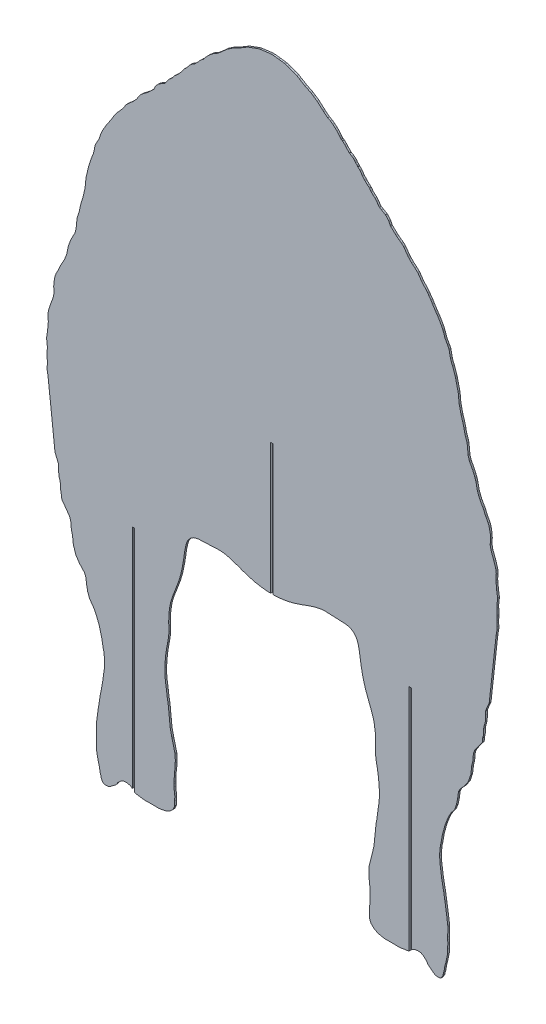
from build123d import *

# Parameters (mm, degrees)
EXTRUDE_1_DEPTH = 2


with BuildPart() as part:
    # Model → Extrude 1 (new body)
    with BuildSketch(Plane.XY):
        Polygon((-5496.2445, 189.9029), (-5495.9096, 189.4966), (-5494.3551, 186.1631), (-5493.4235, 179.621), (-5493.4364, 179.0282), (-5492.0028, 172.1316), (-5491.8416, 171.8408), (-5491.6804, 171.5499), (-5490.0743, 166.7919), (-5489.6801, 166.2414), (-5489.4588, 165.9892), (-5489.2374, 165.737), (-5486.8596, 162.5707), (-5486.5667, 162.237), (-5486.2738, 161.9033), (-5484.7952, 159.28), (-5483.6149, 157.1755), (-5481.8233, 152.959), (-5481.7658, 152.7644), (-5481.7082, 152.5696), (-5480.7843, 150.3208), (-5480.0863, 148.4638), (-5479.4524, 147.0466), (-5479.2418, 146.1877), (-5476.2774, 135.1042), (-5474.7989, 126.6455), (-5474.1593, 124.0295), (-5473.7948, 121.4179), (-5473.392, 116.9064), (-5473.1167, 113.4783), (-5473.4549, 109.7988), (-5473.5587, 106.9177), (-5474.4143, 100.9123), (-5475.4951, 92.9453), (-5476.1924, 89.4713), (-5477.0354, 84.4822), (-5477.8445, 80.8982), (-5479.0215, 73.1225), (-5479.2856, 71.7514), (-5480.7816, 62.0454), (-5482.3022, 50.7461), (-5482.335, 50.2573), (-5482.3678, 49.7685), (-5482.3807, 48.9289), (-5482.2994, 39.0254), (-5482.2846, 36.1582), (-5482.418, 32.8984), (-5482.1374, 27.2427), (-5482.1283, 22.9883), (-5480.2995, 14.143), (-5480.0821, 13.1252), (-5480.0126, 12.9504), (-5479.943, 12.7754), (-5479.8217, 12.2882), (-5479.7004, 11.801), (-5478.7688, 8.2534), (-5478.5633, 5.9324), (-5478.0259, 3.5652), (-5477.6842, 2.6575), (-5477.1875, 0.3865), (-5476.9723, -0.7583), (-5475.4734, -3.2901), (-5475.135, -4.0174), (-5474.6471, -4.3303), (-5472.6105, -5.0435), (-5470.0517, -4.833), (-5468.8631, -4.739), (-5467.9083, -4.3711), (-5464.1485, -1.6074), (-5460.7275, 1.0117), (-5460.0107, 1.8904), (-5458.4354, 4.2187), (-5458.1438, 4.6213), (-5454.8446, 7.6282), (-5453.4923, 8.2492), (-5452.1635, 8.935), (-5449.5111, 9.2304), (-5449.0866, 9.2051), (-5448.6621, 9.1794), (-5448.5307, 9.1855), (-5448.3992, 9.1916), (-5447.2, 8.9678), (-5445.5066, 8.6291), (-5444.0579, 8.3113), (-5442.2299, 6.7488), (-5442.2299, 260.5305), (-5441.9799, 260.5305), (-5439.9799, 260.5305), (-5439.7299, 260.5305), (-5439.7299, 4.612), (-5438.7787, 3.7991), (-5434.6053, 3.1968), (-5430.5375, 2.5481), (-5427.125, 2.2878), (-5418.6017, 2.4498), (-5418.4295, 2.4263), (-5418.2572, 2.4028), (-5418.0674, 2.3752), (-5417.8775, 2.3476), (-5414.0434, 2.4126), (-5413.2241, 2.2605), (-5409.9278, 2.5803), (-5404.4787, 3.842), (-5404.2971, 3.862), (-5404.1256, 3.9563), (-5403.9541, 4.0503), (-5400.4633, 5.7129), (-5399.5392, 6.4496), (-5396.795, 9.0265), (-5396.635, 9.2409), (-5396.475, 9.4553), (-5395.3647, 11.9946), (-5394.8888, 13.2324), (-5394.7879, 18.3425), (-5394.5776, 22.6931), (-5394.7191, 24.8401), (-5395.2345, 28.1706), (-5395.3371, 31.6555), (-5395.4515, 34.6379), (-5395.3511, 36.647), (-5395.2123, 40.7546), (-5395.0561, 42.5802), (-5395.03, 45.147), (-5394.4729, 49.5852), (-5394.1224, 55.52), (-5394.0329, 58.1006), (-5394.3614, 63.8605), (-5394.4182, 64.4795), (-5394.5711, 65.0762), (-5397.6181, 77.3454), (-5397.8001, 77.905), (-5398.0493, 79.0061), (-5399.6808, 86.3602), (-5400.5667, 94.6023), (-5401.1657, 100.3725), (-5401.7546, 106.4187), (-5402.2491, 110.143), (-5403.0003, 114.0029), (-5403.9308, 121.3982), (-5405.2401, 130.3126), (-5405.2654, 130.8271), (-5405.7104, 135.5456), (-5405.7179, 141.811), (-5405.6925, 143.3755), (-5405.4861, 147.0115), (-5404.7015, 155.7778), (-5404.2753, 158.4779), (-5403.5142, 163.4328), (-5403.4329, 163.742), (-5402.5777, 168.0011), (-5402.4852, 168.4367), (-5401.8722, 172.4641), (-5401.2971, 177.0744), (-5401.243, 179.0469), (-5401.3137, 184.6592), (-5401.4301, 188.1054), (-5401.225, 196.1673), (-5401.1626, 197.2118), (-5400.453, 202.1882), (-5400.1592, 204.4477), (-5400.0922, 204.7002), (-5399.1198, 209.3453), (-5396.9029, 216.0772), (-5396.5681, 217.073), (-5395.5662, 219.4718), (-5393.1942, 225.6994), (-5390.6319, 232.5133), (-5389.0655, 237.5125), (-5387.8519, 241.9003), (-5386.7918, 246.574), (-5385.8331, 251.2091), (-5385.298, 254.2684), (-5384.5135, 259.1114), (-5383.836, 263.798), (-5383.3877, 266.9922), (-5382.6923, 270.2218), (-5382.0459, 273.2052), (-5381.0132, 276.1477), (-5380.199, 277.9815), (-5379.4204, 279.1903), (-5378.6526, 280.029), (-5377.137, 282.0069), (-5375.0265, 283.3319), (-5374.0647, 283.9898), (-5372.4247, 284.6144), (-5369.9607, 285.2689), (-5368.4474, 285.6445), (-5344.728, 286.6764), (-5340.5729, 286.369), (-5340.4043, 286.373), (-5340.0835, 286.36), (-5339.2209, 286.1743), (-5333.6626, 285.0128), (-5329.7618, 283.6271), (-5327.3638, 282.9614), (-5323.4804, 281.5655), (-5320.6819, 280.5334), (-5318.4154, 279.6736), (-5312.1751, 277.628), (-5306.9514, 276.1664), (-5304.8312, 275.614), (-5303.2028, 275.3152), (-5298.5116, 274.4743), (-5296.5531, 274.2131), (-5291.688, 273.7102), (-5289.2627, 273.5881), (-5287.2298, 273.546), (-5287.2298, 419.877), (-5286.9799, 419.877), (-5284.9799, 419.877), (-5284.7298, 419.877), (-5284.7298, 273.5372), (-5282.8709, 273.5877), (-5281.9771, 273.6062), (-5279.5518, 273.7285), (-5274.6867, 274.2312), (-5272.7281, 274.4925), (-5268.0369, 275.3334), (-5266.4085, 275.6322), (-5264.2884, 276.1846), (-5259.0647, 277.6462), (-5252.8244, 279.6919), (-5250.5579, 280.5516), (-5247.7593, 281.5837), (-5243.876, 282.9797), (-5241.4779, 283.6453), (-5237.5772, 285.0309), (-5232.0188, 286.1925), (-5231.1563, 286.3782), (-5230.8354, 286.3912), (-5230.6669, 286.3872), (-5226.5118, 286.6946), (-5202.7923, 285.6626), (-5201.2791, 285.2871), (-5198.8151, 284.6326), (-5197.175, 284.0081), (-5196.2132, 283.3501), (-5194.1028, 282.0251), (-5192.5872, 280.0472), (-5191.8194, 279.2085), (-5191.0408, 277.9997), (-5190.2266, 276.1659), (-5189.1939, 273.2234), (-5188.5475, 270.24), (-5187.8521, 267.0104), (-5187.4037, 263.8162), (-5186.7264, 259.1296), (-5185.9418, 254.2866), (-5185.4066, 251.2273), (-5184.4479, 246.5922), (-5183.3879, 241.9185), (-5182.1742, 237.5307), (-5180.6079, 232.5315), (-5178.0456, 225.7177), (-5175.6736, 219.4901), (-5174.6717, 217.0913), (-5174.3368, 216.0954), (-5172.1199, 209.3635), (-5171.1476, 204.7184), (-5171.0806, 204.4659), (-5170.7867, 202.2064), (-5170.0772, 197.23), (-5170.0147, 196.1855), (-5169.8097, 188.1236), (-5169.9261, 184.6773), (-5169.9967, 179.0652), (-5169.9427, 177.0925), (-5169.3676, 172.4823), (-5168.7545, 168.4551), (-5168.662, 168.0193), (-5167.8069, 163.7602), (-5167.7256, 163.4512), (-5166.9645, 158.4961), (-5166.5382, 155.7961), (-5165.7537, 147.0295), (-5165.5473, 143.3938), (-5165.5218, 141.8293), (-5165.5295, 135.5639), (-5165.9743, 130.8452), (-5165.9997, 130.3308), (-5167.309, 121.4165), (-5168.2394, 114.021), (-5168.9906, 110.1614), (-5169.4851, 106.437), (-5170.074, 100.3909), (-5170.673, 94.6205), (-5171.5589, 86.3784), (-5173.1905, 79.0244), (-5173.4397, 77.9232), (-5173.6216, 77.3635), (-5176.6686, 65.0942), (-5176.8216, 64.4978), (-5176.8785, 63.8786), (-5177.2069, 58.1186), (-5177.1173, 55.5381), (-5176.7669, 49.6035), (-5176.2097, 45.1653), (-5176.1837, 42.5984), (-5176.0275, 40.7729), (-5175.8887, 36.6653), (-5175.7882, 34.6562), (-5175.9026, 31.6738), (-5176.0053, 28.1887), (-5176.5207, 24.8584), (-5176.6621, 22.7112), (-5176.4518, 18.3606), (-5176.351, 13.2507), (-5175.8752, 12.0129), (-5174.7648, 9.4736), (-5174.6048, 9.259), (-5174.4447, 9.0447), (-5171.7006, 6.4678), (-5170.7764, 5.7309), (-5167.2857, 4.0686), (-5166.9427, 3.8804), (-5166.761, 3.8603), (-5161.3119, 2.5984), (-5158.0157, 2.2788), (-5157.1963, 2.4309), (-5153.3622, 2.3658), (-5153.1724, 2.3935), (-5152.9826, 2.4211), (-5152.638, 2.468), (-5144.1148, 2.3059), (-5140.7022, 2.5663), (-5136.6344, 3.2151), (-5132.4611, 3.8174), (-5132.2299, 4.0149), (-5132.2299, 260.5305), (-5131.9799, 260.5305), (-5129.9799, 260.5305), (-5129.7299, 260.5305), (-5129.7299, 6.1517), (-5127.1819, 8.3293), (-5125.7344, 8.6472), (-5124.0347, 8.9868), (-5122.8405, 9.2099), (-5122.5777, 9.1977), (-5121.7287, 9.2488), (-5119.0762, 8.9534), (-5117.7473, 8.2676), (-5116.3952, 7.6462), (-5113.096, 4.6394), (-5112.8044, 4.237), (-5111.229, 1.9087), (-5110.5122, 1.0298), (-5107.0912, -1.5894), (-5103.3315, -4.3528), (-5102.3766, -4.721), (-5101.188, -4.8147), (-5098.6293, -5.0254), (-5096.5927, -4.312), (-5096.1046, -3.9993), (-5095.7663, -3.2717), (-5094.2674, -0.7403), (-5094.0522, 0.4048), (-5093.5555, 2.6755), (-5093.2138, 3.5832), (-5092.6764, 5.9504), (-5092.471, 8.2715), (-5091.5393, 11.8191), (-5091.2967, 12.7937), (-5091.1576, 13.1435), (-5090.9402, 14.1611), (-5089.1114, 23.0066), (-5089.1023, 27.2607), (-5088.8218, 32.9165), (-5088.9552, 36.1765), (-5088.9403, 39.0437), (-5088.859, 48.947), (-5088.8721, 49.7868), (-5088.9377, 50.7641), (-5090.458, 62.0635), (-5091.9541, 71.7698), (-5092.2182, 73.1406), (-5093.3952, 80.9165), (-5094.2044, 84.5005), (-5095.0473, 89.4895), (-5095.7445, 92.9636), (-5096.8254, 100.9306), (-5097.6811, 106.9358), (-5097.7848, 109.8169), (-5098.1231, 113.4963), (-5097.8477, 116.9245), (-5097.445, 121.4363), (-5097.0805, 124.0478), (-5096.4408, 126.6636), (-5094.9624, 135.1223), (-5091.998, 146.206), (-5091.7874, 147.0647), (-5091.1535, 148.4822), (-5090.4555, 150.3388), (-5089.5315, 152.5879), (-5089.4164, 152.9773), (-5087.6248, 157.1936), (-5086.4446, 159.2981), (-5084.966, 161.9214), (-5084.3802, 162.5888), (-5082.0024, 165.7552), (-5081.5597, 166.2596), (-5081.1654, 166.81), (-5079.5594, 171.5681), (-5079.2368, 172.1498), (-5077.8033, 179.0464), (-5077.8162, 179.6391), (-5076.8756, 186.2084), (-5075.3302, 189.5149), (-5074.9953, 189.9211), (-5070.2549, 195.0317), (-5067.4744, 199.1148), (-5066.7221, 200.2868), (-5066.3842, 200.7108), (-5065.743, 201.8237), (-5064.6653, 205.0553), (-5063.9584, 207.6759), (-5063.1443, 209.5178), (-5062.1922, 217.4028), (-5062.0937, 218.5948), (-5060.8835, 223.4414), (-5060.4403, 227.1481), (-5060.3356, 229.7598), (-5059.9777, 231.8676), (-5059.8001, 232.7123), (-5058.6982, 235.6195), (-5057.3608, 237.4139), (-5055.286, 240.6368), (-5051.8067, 245.2318), (-5050.4565, 246.9567), (-5050.1734, 247.4129), (-5049.8714, 249.5642), (-5050.0432, 251.3419), (-5049.3152, 253.1749), (-5048.9193, 255.3772), (-5048.638, 261.0132), (-5048.6415, 261.8511), (-5048.1311, 264.2715), (-5046.8805, 268.9176), (-5046.7858, 269.6905), (-5046.7941, 270.0367), (-5046.3373, 276.3331), (-5046.6477, 279.1266), (-5046.5723, 279.8292), (-5043.2648, 287.8219), (-5042.8571, 288.6746), (-5042.523, 289.2183), (-5034.7941, 358.4404), (-5033.9411, 363.7396), (-5033.7005, 364.9829), (-5033.6393, 367.796), (-5034.0251, 371.3267), (-5034.0122, 373.0443), (-5033.5434, 377.2124), (-5033.4755, 378.4899), (-5033.543, 378.9758), (-5033.7709, 384.7782), (-5033.8905, 385.6756), (-5033.835, 388.5327), (-5033.0426, 395.6138), (-5033.0308, 395.8), (-5033.0113, 395.9221), (-5034.0009, 402.2862), (-5034.1834, 403.6155), (-5034.7428, 409.8151), (-5034.9175, 411.6043), (-5035.0041, 412.3087), (-5034.69, 417.1799), (-5034.5666, 418.7158), (-5034.8029, 421.4727), (-5035.1881, 423.4365), (-5037.1684, 429.8677), (-5040.4348, 438.5483), (-5041.3296, 443.1146), (-5041.3691, 443.3788), (-5041.3267, 444.4403), (-5041.2123, 445.7647), (-5041.05, 449.1643), (-5041.0439, 449.8028), (-5041.2307, 453.8414), (-5042.2644, 459.2745), (-5042.581, 460.5488), (-5043.7065, 463.6885), (-5045.5797, 467.0448), (-5046.3013, 468.5767), (-5046.8667, 469.5445), (-5048.4388, 473.2829), (-5049.5841, 475.5612), (-5052.7362, 481.0906), (-5054.006, 484.0773), (-5054.4533, 485.3843), (-5055.4709, 487.8962), (-5055.7193, 488.7455), (-5057.2304, 496.1335), (-5057.4883, 497.1829), (-5058.148, 499.1667), (-5058.4252, 500.0277), (-5058.4688, 500.1317), (-5058.5653, 500.4221), (-5059.5772, 502.834), (-5060.9157, 506.0546), (-5064.0276, 511.9442), (-5064.5601, 512.9406), (-5064.8484, 513.6022), (-5065.2777, 515.0453), (-5066.0171, 517.7166), (-5066.0555, 517.9199), (-5066.1033, 518.3999), (-5067.2262, 529.1884), (-5067.9337, 531.5906), (-5068.857, 534.2577), (-5069.5998, 536.4085), (-5070.4163, 540.1633), (-5070.6985, 541.5399), (-5070.7475, 541.9412), (-5072.1618, 547.3559), (-5073.7014, 552.4192), (-5073.897, 553.0191), (-5074.1014, 553.6592), (-5075.2986, 559.0795), (-5075.61, 560.6137), (-5076.1664, 562.4688), (-5076.7587, 568.8933), (-5077.0398, 572.0284), (-5077.3553, 573.8033), (-5079.0506, 581.0061), (-5080.0185, 585.034), (-5080.0987, 585.2922), (-5080.3587, 586.4795), (-5080.7127, 587.6883), (-5083.3742, 595.59), (-5083.5474, 595.9801), (-5083.6137, 596.1753), (-5084.9306, 599.1236), (-5085.699, 601.4732), (-5085.8715, 602.2506), (-5086.5213, 605.3258), (-5087.335, 609.4992), (-5087.3872, 609.7352), (-5087.6238, 610.4343), (-5088.5968, 612.3618), (-5089.0039, 613.0687), (-5089.5419, 614.1323), (-5090.6342, 616.0877), (-5091.3391, 617.3135), (-5091.8114, 618.2608), (-5092.3152, 619.4171), (-5092.7061, 620.5995), (-5092.9919, 621.5558), (-5093.3745, 622.6217), (-5093.751, 623.7605), (-5093.9125, 624.1204), (-5094.1559, 624.7987), (-5094.5435, 625.6594), (-5095.9634, 628.8488), (-5099.9745, 635.5974), (-5100.6933, 636.7075), (-5100.8407, 636.9388), (-5101.3076, 637.5334), (-5102.372, 639.1269), (-5103.0606, 640.1999), (-5105.9508, 644.5805), (-5107.8858, 647.8319), (-5109.8957, 650.6239), (-5110.5078, 651.4879), (-5111.3583, 652.7647), (-5112.0617, 653.7685), (-5113.1313, 654.8969), (-5118.2248, 660.6872), (-5120.7997, 664.425), (-5122.022, 666.2785), (-5122.8727, 667.2396), (-5125.8738, 669.9841), (-5128.0208, 671.8438), (-5129.314, 672.8506), (-5131.991, 675.6975), (-5132.193, 675.8821), (-5133.0651, 676.8199), (-5133.34, 677.1419), (-5133.4427, 677.2956), (-5134.3203, 678.5334), (-5137.7677, 683.4863), (-5137.9169, 683.7065), (-5138.3656, 684.1877), (-5140.1219, 685.9353), (-5140.9584, 686.5306), (-5141.0432, 686.6111), (-5143.4403, 688.3244), (-5145.8907, 690.1017), (-5146.93, 691.0391), (-5148.0558, 692.0564), (-5152.7876, 696.5155), (-5152.9189, 696.6485), (-5153.1773, 697.0911), (-5153.4561, 697.6513), (-5154.7262, 700.3167), (-5155.1989, 701.115), (-5157.6982, 703.8479), (-5158.6642, 704.8894), (-5158.954, 705.0564), (-5159.0568, 705.1352), (-5162.8114, 707.2138), (-5163.4601, 707.5739), (-5165.3329, 708.6862), (-5165.9826, 709.4375), (-5166.9042, 710.5417), (-5168.5414, 713.0396), (-5170.2736, 715.2407), (-5170.4103, 715.3523), (-5172.3112, 716.8386), (-5174.412, 718.8698), (-5175.2454, 720.02), (-5176.6067, 721.9037), (-5177.3058, 722.3524), (-5178.8534, 723.7779), (-5181.3047, 726.1082), (-5182.1029, 727.0691), (-5184.3199, 729.5573), (-5184.6825, 730.0232), (-5186.9003, 733.3016), (-5187.4988, 733.913), (-5189.6221, 735.8335), (-5190.1441, 736.6428), (-5190.3085, 736.812), (-5190.5365, 737.1518), (-5191.8145, 738.4364), (-5192.2515, 738.9975), (-5193.0279, 740.0662), (-5193.653, 740.7514), (-5193.7842, 740.8616), (-5194.0879, 741.1934), (-5195.1302, 742.0375), (-5196.0185, 742.6542), (-5196.1302, 742.7412), (-5196.2445, 742.8111), (-5196.3466, 742.8817), (-5198.8557, 744.4318), (-5199.064, 744.5517), (-5199.3466, 744.8617), (-5202.7245, 748.2428), (-5204.378, 750.1881), (-5206.8123, 752.5511), (-5207.44, 752.8542), (-5207.9518, 753.0932), (-5208.3108, 753.2658), (-5208.9171, 753.9361), (-5209.48, 754.7445), (-5210.0413, 755.5661), (-5210.1126, 755.6533), (-5210.2045, 755.7853), (-5211.392, 757.2257), (-5213.174, 759.1156), (-5214.8889, 760.8438), (-5217.6465, 763.1935), (-5220.1735, 765.1009), (-5223.1254, 766.4351), (-5223.3573, 766.55), (-5227.6885, 770.1647), (-5228.7314, 771.0216), (-5228.9402, 771.2144), (-5235.2218, 776.8455), (-5239.1795, 779.5213), (-5241.815, 781.2598), (-5243.1548, 782.0095), (-5246.3211, 783.5489), (-5248.492, 784.6127), (-5254.5843, 788.1919), (-5257.9969, 790.315), (-5261.5255, 791.6499), (-5266.364, 793.3762), (-5267.9052, 794.0177), (-5268.3997, 794.1441), (-5270.7198, 794.9286), (-5271.8709, 795.1604), (-5272.1304, 795.2611), (-5277.9157, 796.0246), (-5278.1049, 796.0474), (-5278.4278, 796.0851), (-5284.3705, 796.7863), (-5286.8345, 796.791), (-5293.1042, 796.0696), (-5298.443, 795.3651), (-5298.9361, 795.2658), (-5299.1416, 795.2305), (-5300.5199, 794.9467), (-5303.1974, 794.0392), (-5303.3345, 793.9995), (-5304.8756, 793.3581), (-5308.3654, 792.1129), (-5309.9397, 791.5731), (-5313.2202, 790.3253), (-5316.7648, 788.1228), (-5322.7409, 784.6029), (-5324.8895, 783.5469), (-5327.9536, 782.0819), (-5329.3591, 781.2938), (-5331.872, 779.6397), (-5335.9052, 776.9075), (-5336.0179, 776.8273), (-5341.8514, 771.598), (-5342.2452, 771.2771), (-5342.4384, 771.0908), (-5342.554, 770.9658), (-5343.5512, 770.1465), (-5346.6599, 767.552), (-5347.9014, 766.5387), (-5348.2637, 766.3494), (-5351.0662, 765.0827), (-5351.7631, 764.5567), (-5353.2077, 763.4875), (-5353.4525, 763.2815), (-5353.5933, 763.1753), (-5354.6938, 762.2376), (-5356.3003, 760.8864), (-5358.1009, 759.0849), (-5359.8025, 757.2915), (-5361.1984, 755.5841), (-5362.3074, 753.9611), (-5362.9051, 753.2956), (-5364.3875, 752.5822), (-5366.8543, 750.1806), (-5366.9837, 750.0265), (-5368.5152, 748.2246), (-5371.8932, 744.8435), (-5372.166, 744.5462), (-5372.2973, 744.4761), (-5375.1095, 742.7594), (-5375.6456, 742.3413), (-5376.1096, 742.0193), (-5377.1518, 741.1752), (-5377.3115, 741.0008), (-5377.5868, 740.7696), (-5378.2119, 740.0844), (-5379.4022, 738.448), (-5380.7032, 737.1337), (-5380.8523, 736.9114), (-5381.0957, 736.661), (-5381.6739, 735.7644), (-5383.7409, 733.8948), (-5383.8813, 733.7523), (-5384.0977, 733.5303), (-5384.3576, 733.2631), (-5384.6067, 732.8885), (-5386.5572, 730.0048), (-5386.7942, 729.7005), (-5388.5734, 727.7194), (-5388.7843, 727.4464), (-5389.1368, 727.0509), (-5389.9351, 726.0899), (-5392.3863, 723.7598), (-5393.8665, 722.3964), (-5394.5196, 721.9651), (-5394.633, 721.8855), (-5395.9944, 720.0019), (-5396.7575, 718.9486), (-5398.8716, 716.9012), (-5400.8175, 715.3859), (-5400.9385, 715.2438), (-5402.6984, 713.0214), (-5404.2244, 710.6931), (-5405.8617, 708.7312), (-5408.0114, 707.4544), (-5412.5882, 704.8965), (-5413.5415, 703.8662), (-5416.0196, 701.1668), (-5416.1787, 700.9231), (-5416.5135, 700.2985), (-5417.377, 698.4864), (-5418.1856, 696.862), (-5418.2688, 696.7195), (-5418.4521, 696.5337), (-5423.669, 691.6175), (-5425.1855, 690.2386), (-5427.7994, 688.3426), (-5430.1965, 686.6294), (-5430.4341, 686.4038), (-5431.118, 685.9171), (-5432.8741, 684.1694), (-5433.3228, 683.6883), (-5433.472, 683.4681), (-5435.5406, 680.4962), (-5437.7971, 677.3139), (-5437.8998, 677.1601), (-5438.1747, 676.8381), (-5439.5537, 675.355), (-5441.9258, 672.8324), (-5443.219, 671.8256), (-5444.4347, 670.7725), (-5445.2944, 670.0451), (-5446.2801, 669.13), (-5448.367, 667.2213), (-5449.2177, 666.2603), (-5449.3206, 666.1076), (-5450.5602, 664.2322), (-5451.3483, 663.0882), (-5453.0633, 660.6139), (-5456.2878, 656.9485), (-5458.0998, 654.9197), (-5459.2334, 653.7252), (-5459.8814, 652.783), (-5460.7319, 651.5061), (-5462.9718, 648.3448), (-5463.1629, 648.0792), (-5463.354, 647.8137), (-5464.9944, 645.0571), (-5465.2777, 644.5863), (-5466.951, 642.0431), (-5468.1792, 640.1817), (-5468.2232, 640.1131), (-5468.2672, 640.0444), (-5469.9321, 637.5516), (-5470.399, 636.957), (-5471.0064, 636.0044), (-5471.1946, 635.6881), (-5471.2652, 635.5792), (-5474.4293, 630.2556), (-5475.1043, 629.1209), (-5475.2763, 628.8306), (-5476.6962, 625.6413), (-5477.0838, 624.7805), (-5477.1729, 624.5323), (-5477.2621, 624.284), (-5477.4887, 623.7787), (-5478.0174, 622.1797), (-5478.2478, 621.5376), (-5478.3339, 621.2495), (-5478.42, 620.9616), (-5478.9246, 619.4353), (-5479.554, 617.9904), (-5479.7273, 617.6428), (-5479.9007, 617.2953), (-5480.6056, 616.0695), (-5481.6978, 614.1141), (-5482.0844, 613.3497), (-5482.6429, 612.38), (-5483.6159, 610.4525), (-5483.8525, 609.7534), (-5483.8825, 609.6062), (-5483.9125, 609.4591), (-5484.7184, 605.3075), (-5485.2063, 602.9987), (-5485.5407, 601.4914), (-5486.3092, 599.1417), (-5487.6261, 596.1935), (-5487.6857, 596.0182), (-5487.7453, 595.8428), (-5487.8055, 595.7073), (-5487.8655, 595.5717), (-5490.5392, 587.6286), (-5490.5915, 587.4686), (-5490.765, 586.8862), (-5490.7787, 586.8248), (-5490.7925, 586.7634), (-5490.881, 586.4613), (-5491.0555, 585.6647), (-5491.1154, 585.4143), (-5491.1753, 585.1639), (-5491.1983, 585.0899), (-5491.2212, 585.0158), (-5492.1891, 580.9879), (-5493.8845, 573.7851), (-5494.1999, 572.0102), (-5494.4004, 569.7736), (-5494.4298, 569.4611), (-5494.4592, 569.1486), (-5495.0782, 562.4345), (-5495.6297, 560.5955), (-5495.9411, 559.0613), (-5497.1123, 553.7591), (-5497.2276, 553.3982), (-5497.3427, 553.0374), (-5497.4825, 552.5718), (-5497.5104, 552.4864), (-5497.5382, 552.4009), (-5499.078, 547.3377), (-5499.1558, 547.0397), (-5499.2336, 546.7417), (-5499.3045, 546.5056), (-5499.3942, 546.1444), (-5499.4839, 545.7833), (-5500.4922, 541.923), (-5500.5168, 541.7223), (-5500.5412, 541.5216), (-5500.6939, 540.7766), (-5501.64, 536.4268), (-5503.2409, 531.7829), (-5503.2661, 531.6987), (-5503.2914, 531.6145), (-5504.0136, 529.1702), (-5505.1365, 518.3817), (-5505.1481, 518.2655), (-5505.1596, 518.1492), (-5505.1775, 517.9795), (-5505.2, 517.8572), (-5505.2226, 517.7349), (-5506.1046, 514.5483), (-5506.248, 514.0662), (-5506.3914, 513.584), (-5506.5356, 513.2532), (-5506.6797, 512.9224), (-5507.2121, 511.926), (-5508.8802, 508.769), (-5509.138, 508.2955), (-5510.1087, 506.4711), (-5510.1374, 506.4033), (-5510.166, 506.3354), (-5510.324, 506.0365), (-5511.6626, 502.8157), (-5512.6743, 500.4039), (-5512.7127, 500.2886), (-5512.7636, 500.1672), (-5512.8145, 500.0458), (-5513.4612, 498.0378), (-5513.6064, 497.6013), (-5513.7515, 497.1647), (-5514.0094, 496.1153), (-5515.5205, 488.7274), (-5515.7688, 487.878), (-5516.7864, 485.3662), (-5517.2337, 484.0591), (-5518.5035, 481.0725), (-5521.6556, 475.543), (-5522.8009, 473.2647), (-5524.373, 469.5262), (-5524.9384, 468.5586), (-5525.6599, 467.0266), (-5527.5332, 463.6704), (-5528.6588, 460.5306), (-5528.9754, 459.2564), (-5530.0091, 453.8232), (-5530.196, 449.7845), (-5530.1897, 449.1461), (-5530.0275, 445.7465), (-5529.9131, 444.4221), (-5529.8919, 443.8914), (-5529.8707, 443.3605), (-5529.8904, 443.2285), (-5529.9102, 443.0964), (-5530.8048, 438.53), (-5534.0714, 429.8495), (-5536.0515, 423.4183), (-5536.4369, 421.4544), (-5536.6733, 418.6975), (-5536.5498, 417.1617), (-5536.2356, 412.2905), (-5536.3223, 411.5862), (-5536.4969, 409.7969), (-5537.0564, 403.5974), (-5537.2389, 402.2681), (-5538.2284, 395.9039), (-5538.2187, 395.8429), (-5538.209, 395.7818), (-5538.1971, 395.5956), (-5537.4048, 388.5145), (-5537.3493, 385.6574), (-5537.4688, 384.76), (-5537.6967, 378.9576), (-5537.7305, 378.7146), (-5537.7643, 378.4716), (-5537.6964, 377.1942), (-5537.2274, 373.0261), (-5537.2146, 371.3085), (-5537.6004, 367.7777), (-5537.5393, 364.9647), (-5537.2986, 363.7214), (-5536.4456, 358.4222), (-5528.7167, 289.2001), (-5528.3826, 288.6564), (-5527.9749, 287.8038), (-5524.6675, 279.811), (-5524.6298, 279.4597), (-5524.5921, 279.1084), (-5524.9024, 276.3149), (-5524.4457, 270.0185), (-5524.4497, 269.8454), (-5524.4539, 269.6722), (-5524.3593, 268.8995), (-5523.1086, 264.2533), (-5522.5982, 261.833), (-5522.6, 261.414), (-5522.6017, 260.9951), (-5522.3203, 255.3591), (-5521.9245, 253.1567), (-5521.1965, 251.3237), (-5521.3683, 249.546), (-5521.0664, 247.3947), (-5520.9248, 247.1666), (-5520.7832, 246.9385), (-5519.4331, 245.2136), (-5515.9536, 240.6186), (-5513.8789, 237.3957), (-5512.5417, 235.6013), (-5511.4396, 232.6941), (-5511.3509, 232.2717), (-5511.2621, 231.8494), (-5510.9041, 229.7416), (-5510.7993, 227.1299), (-5510.3562, 223.4233), (-5509.1461, 218.5765), (-5509.0968, 217.9806), (-5509.0476, 217.3846), (-5508.0955, 209.4997), (-5507.2813, 207.6577), (-5506.5744, 205.0371), (-5505.4969, 201.8056), (-5504.8556, 200.6926), (-5504.5177, 200.2688), (-5503.7654, 199.0967), (-5500.9848, 195.0135), align=None)
    extrude(amount=EXTRUDE_1_DEPTH)


solid = part.part
